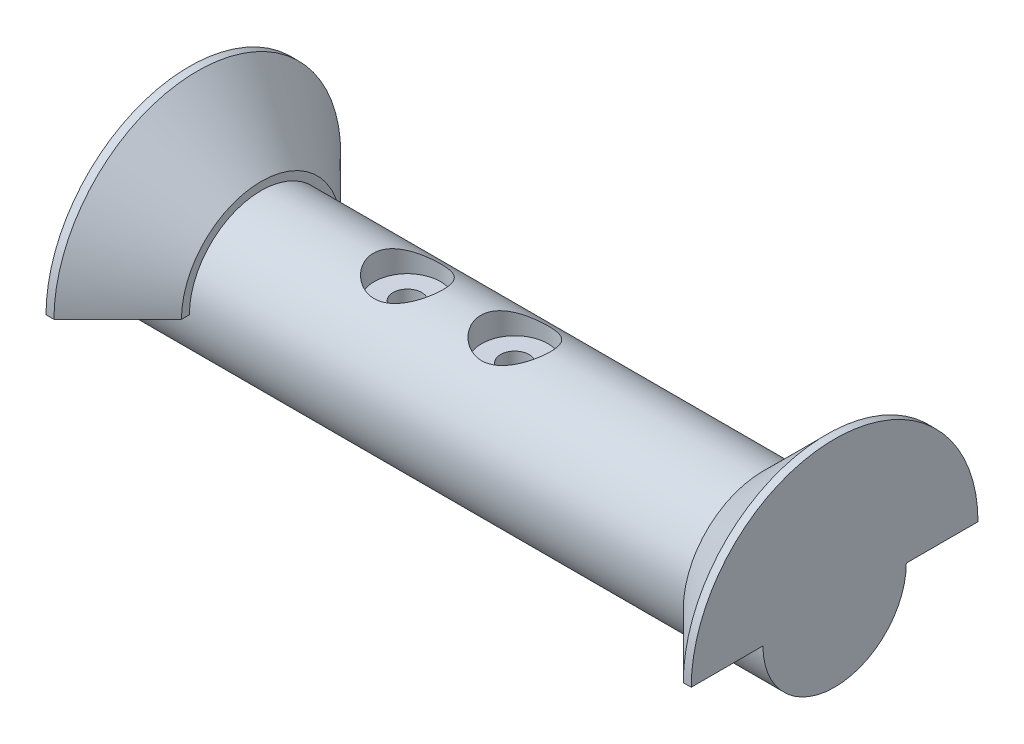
ISO-10303-21;
HEADER;
FILE_DESCRIPTION(('STEP AP214'),'2;1');
FILE_NAME('part.step','',(''),(''),'','','');
FILE_SCHEMA(('AUTOMOTIVE_DESIGN { 1 0 10303 214 1 1 1 1 }'));
ENDSEC;
DATA;
#1=APPLICATION_CONTEXT('core data for automotive mechanical design processes');
#2=APPLICATION_PROTOCOL_DEFINITION('international standard','automotive_design',2000,#1);
#3=PRODUCT_CONTEXT('',#1,'mechanical');
#4=PRODUCT('Part','Part','',(#3));
#5=PRODUCT_RELATED_PRODUCT_CATEGORY('part','',(#4));
#6=PRODUCT_DEFINITION_FORMATION('','',#4);
#7=PRODUCT_DEFINITION_CONTEXT('part definition',#1,'design');
#8=PRODUCT_DEFINITION('design','',#6,#7);
#9=PRODUCT_DEFINITION_SHAPE('','',#8);
#10=(LENGTH_UNIT() NAMED_UNIT(*) SI_UNIT(.MILLI.,.METRE.));
#11=(NAMED_UNIT(*) PLANE_ANGLE_UNIT() SI_UNIT($,.RADIAN.));
#12=(NAMED_UNIT(*) SI_UNIT($,.STERADIAN.) SOLID_ANGLE_UNIT());
#13=UNCERTAINTY_MEASURE_WITH_UNIT(LENGTH_MEASURE(1.E-05),#10,'distance_accuracy_value','');
#14=(GEOMETRIC_REPRESENTATION_CONTEXT(3) GLOBAL_UNCERTAINTY_ASSIGNED_CONTEXT((#13)) GLOBAL_UNIT_ASSIGNED_CONTEXT((#10,
#11,#12)) REPRESENTATION_CONTEXT('',''));
#15=CARTESIAN_POINT('',(0.,0.,0.));
#16=DIRECTION('',(0.,0.,1.));
#17=DIRECTION('',(1.,0.,0.));
#18=AXIS2_PLACEMENT_3D('',#15,#16,#17);
#19=CARTESIAN_POINT('',(-45.,0.,0.));
#20=DIRECTION('',(1.,0.,0.));
#21=DIRECTION('',(0.,0.,-1.));
#22=AXIS2_PLACEMENT_3D('',#19,#20,#21);
#23=CYLINDRICAL_SURFACE('',#22,10.);
#24=CARTESIAN_POINT('',(-14.986,9.06225504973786,4.22794671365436));
#25=CARTESIAN_POINT('',(-15.1094369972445,9.0622561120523,4.22794575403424));
#26=CARTESIAN_POINT('',(-15.2328995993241,9.06456878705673,4.22299840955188));
#27=CARTESIAN_POINT('',(-15.4789147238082,9.07373677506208,4.2032624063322));
#28=CARTESIAN_POINT('',(-15.6014667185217,9.08059454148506,4.18846843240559));
#29=CARTESIAN_POINT('',(-15.8449162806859,9.09862026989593,4.14916605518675));
#30=CARTESIAN_POINT('',(-15.9658104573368,9.10979600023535,4.12464014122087));
#31=CARTESIAN_POINT('',(-16.2048752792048,9.13605385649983,4.06614510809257));
#32=CARTESIAN_POINT('',(-16.3230447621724,9.15113761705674,4.03217203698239));
#33=CARTESIAN_POINT('',(-16.6712062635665,9.20135800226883,3.91689784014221));
#34=CARTESIAN_POINT('',(-16.8961363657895,9.24156751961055,3.82203051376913));
#35=CARTESIAN_POINT('',(-17.3268098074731,9.33059345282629,3.59921175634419));
#36=CARTESIAN_POINT('',(-17.5325549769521,9.37940904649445,3.47126348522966));
#37=CARTESIAN_POINT('',(-17.9326336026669,9.4833008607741,3.1769133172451));
#38=CARTESIAN_POINT('',(-18.1255721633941,9.5385766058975,3.0086845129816));
#39=CARTESIAN_POINT('',(-18.4815969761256,9.6465289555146,2.64213175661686));
#40=CARTESIAN_POINT('',(-18.6446732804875,9.69920468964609,2.44379781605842));
#41=CARTESIAN_POINT('',(-18.8662389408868,9.77263122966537,2.12329258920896));
#42=CARTESIAN_POINT('',(-18.9373142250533,9.79655407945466,2.01035384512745));
#43=CARTESIAN_POINT('',(-19.0696553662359,9.84131860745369,1.77830770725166));
#44=CARTESIAN_POINT('',(-19.1309254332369,9.86216160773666,1.65920299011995));
#45=CARTESIAN_POINT('',(-19.2430876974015,9.90006034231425,1.41562767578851));
#46=CARTESIAN_POINT('',(-19.293980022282,9.9171161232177,1.29115714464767));
#47=CARTESIAN_POINT('',(-19.3848400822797,9.94681518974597,1.03784109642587));
#48=CARTESIAN_POINT('',(-19.424813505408,9.95946077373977,0.90899789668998));
#49=CARTESIAN_POINT('',(-19.4911949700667,9.97918468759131,0.65640574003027));
#50=CARTESIAN_POINT('',(-19.5183139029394,9.98657053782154,0.532867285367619));
#51=CARTESIAN_POINT('',(-19.5623493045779,9.99674681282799,0.283850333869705));
#52=CARTESIAN_POINT('',(-19.5792703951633,9.99953932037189,0.158372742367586));
#53=CARTESIAN_POINT('',(-19.6027641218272,10.000355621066,-0.0935473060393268));
#54=CARTESIAN_POINT('',(-19.6093380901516,9.99838002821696,-0.219989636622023));
#55=CARTESIAN_POINT('',(-19.6121072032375,9.98961685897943,-0.472816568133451));
#56=CARTESIAN_POINT('',(-19.6083026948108,9.98282944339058,-0.599201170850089));
#57=CARTESIAN_POINT('',(-19.5909634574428,9.96510045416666,-0.843073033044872));
#58=CARTESIAN_POINT('',(-19.5780478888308,9.95444314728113,-0.960625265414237));
#59=CARTESIAN_POINT('',(-19.5433515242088,9.92915870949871,-1.19399238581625));
#60=CARTESIAN_POINT('',(-19.5215678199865,9.91453027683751,-1.309806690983));
#61=CARTESIAN_POINT('',(-19.443266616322,9.8650662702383,-1.65342215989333));
#62=CARTESIAN_POINT('',(-19.3737831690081,9.82463571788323,-1.87761122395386));
#63=CARTESIAN_POINT('',(-19.2003960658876,9.73049842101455,-2.31724070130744));
#64=CARTESIAN_POINT('',(-19.0955135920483,9.67642664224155,-2.53221044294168));
#65=CARTESIAN_POINT('',(-18.8552234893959,9.55984969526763,-2.94188059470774));
#66=CARTESIAN_POINT('',(-18.7198031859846,9.49734102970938,-3.1365725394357));
#67=CARTESIAN_POINT('',(-18.4078102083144,9.36266476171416,-3.51929006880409));
#68=CARTESIAN_POINT('',(-18.22858755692,9.29013879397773,-3.70502767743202));
#69=CARTESIAN_POINT('',(-17.8410263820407,9.14734136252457,-4.04476751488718));
#70=CARTESIAN_POINT('',(-17.6326686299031,9.07707142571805,-4.19874861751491));
#71=CARTESIAN_POINT('',(-17.2967073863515,8.97750681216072,-4.40574733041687));
#72=CARTESIAN_POINT('',(-17.178045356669,8.94466727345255,-4.47186840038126));
#73=CARTESIAN_POINT('',(-16.9345992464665,8.88269769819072,-4.59372910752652));
#74=CARTESIAN_POINT('',(-16.8098179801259,8.85356597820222,-4.6494734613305));
#75=CARTESIAN_POINT('',(-16.5550152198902,8.80007845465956,-4.74993280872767));
#76=CARTESIAN_POINT('',(-16.4249978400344,8.77571898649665,-4.79465627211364));
#77=CARTESIAN_POINT('',(-16.1606193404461,8.732723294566,-4.87252785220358));
#78=CARTESIAN_POINT('',(-16.0262588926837,8.71408619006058,-4.90567775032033));
#79=CARTESIAN_POINT('',(-15.7673895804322,8.68481737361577,-4.95729157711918));
#80=CARTESIAN_POINT('',(-15.6431668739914,8.67359067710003,-4.97685651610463));
#81=CARTESIAN_POINT('',(-15.3931616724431,8.65691111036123,-5.00581385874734));
#82=CARTESIAN_POINT('',(-15.267379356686,8.65145758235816,-5.01520742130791));
#83=CARTESIAN_POINT('',(-15.0154063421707,8.6465424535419,-5.02367671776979));
#84=CARTESIAN_POINT('',(-14.8892158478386,8.64707821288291,-5.02275699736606));
#85=CARTESIAN_POINT('',(-14.6375043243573,8.65411333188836,-5.0106258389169));
#86=CARTESIAN_POINT('',(-14.5119832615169,8.66061238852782,-4.99941492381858));
#87=CARTESIAN_POINT('',(-14.2753001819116,8.67836964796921,-4.96851898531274));
#88=CARTESIAN_POINT('',(-14.1639688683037,8.68908058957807,-4.94980472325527));
#89=CARTESIAN_POINT('',(-13.9434309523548,8.71477609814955,-4.90442139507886));
#90=CARTESIAN_POINT('',(-13.8342250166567,8.72976198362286,-4.87774987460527));
#91=CARTESIAN_POINT('',(-13.5108248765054,8.78050321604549,-4.78619799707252));
#92=CARTESIAN_POINT('',(-13.3006917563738,8.82205483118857,-4.70975945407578));
#93=CARTESIAN_POINT('',(-12.8842717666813,8.91900090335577,-4.52360216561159));
#94=CARTESIAN_POINT('',(-12.678885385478,8.97504891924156,-4.41223609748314));
#95=CARTESIAN_POINT('',(-12.288492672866,9.09420885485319,-4.16109018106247));
#96=CARTESIAN_POINT('',(-12.1034971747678,9.15732449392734,-4.02129534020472));
#97=CARTESIAN_POINT('',(-11.7349329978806,9.2934278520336,-3.69687585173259));
#98=CARTESIAN_POINT('',(-11.5544636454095,9.36665961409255,-3.50882554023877));
#99=CARTESIAN_POINT('',(-11.2267822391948,9.5085287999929,-3.10383370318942));
#100=CARTESIAN_POINT('',(-11.0795812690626,9.57716468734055,-2.88688258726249));
#101=CARTESIAN_POINT('',(-10.8853326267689,9.67274483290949,-2.54027960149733));
#102=CARTESIAN_POINT('',(-10.8243515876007,9.70375553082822,-2.41936505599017));
#103=CARTESIAN_POINT('',(-10.7129657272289,9.76211266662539,-2.17192837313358));
#104=CARTESIAN_POINT('',(-10.66255633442,9.78946068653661,-2.04540868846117));
#105=CARTESIAN_POINT('',(-10.5729094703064,9.83978682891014,-1.78768953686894));
#106=CARTESIAN_POINT('',(-10.533667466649,9.86276672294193,-1.65649199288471));
#107=CARTESIAN_POINT('',(-10.4668530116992,9.90378157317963,-1.39040289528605));
#108=CARTESIAN_POINT('',(-10.43927928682,9.92181706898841,-1.25551174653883));
#109=CARTESIAN_POINT('',(-10.3980594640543,9.95118289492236,-0.994823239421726));
#110=CARTESIAN_POINT('',(-10.3834265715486,9.96295371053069,-0.869230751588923));
#111=CARTESIAN_POINT('',(-10.3644975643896,9.98175379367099,-0.616919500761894));
#112=CARTESIAN_POINT('',(-10.3602006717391,9.98878341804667,-0.490200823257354));
#113=CARTESIAN_POINT('',(-10.362043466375,9.99800256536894,-0.23670085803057));
#114=CARTESIAN_POINT('',(-10.3681800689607,10.0001935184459,-0.109919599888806));
#115=CARTESIAN_POINT('',(-10.3908528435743,9.99977962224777,0.142697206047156));
#116=CARTESIAN_POINT('',(-10.4073887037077,9.99717491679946,0.268532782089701));
#117=CARTESIAN_POINT('',(-10.4492939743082,9.98766366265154,0.510115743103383));
#118=CARTESIAN_POINT('',(-10.4740185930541,9.98104805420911,0.625986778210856));
#119=CARTESIAN_POINT('',(-10.5321940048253,9.96402546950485,0.855243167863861));
#120=CARTESIAN_POINT('',(-10.565647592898,9.95361727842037,0.968627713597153));
#121=CARTESIAN_POINT('',(-10.6786821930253,9.91717031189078,1.30386702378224));
#122=CARTESIAN_POINT('',(-10.77097411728,9.88589989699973,1.52101878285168));
#123=CARTESIAN_POINT('',(-10.9899681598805,9.81163625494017,1.94411132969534));
#124=CARTESIAN_POINT('',(-11.1176989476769,9.76829239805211,2.1494513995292));
#125=CARTESIAN_POINT('',(-11.4026432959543,9.6749124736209,2.53688878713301));
#126=CARTESIAN_POINT('',(-11.5598681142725,9.62487385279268,2.71897718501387));
#127=CARTESIAN_POINT('',(-11.9139130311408,9.51902322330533,3.06992663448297));
#128=CARTESIAN_POINT('',(-12.112893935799,9.4630695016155,3.23656582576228));
#129=CARTESIAN_POINT('',(-12.5370483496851,9.35572344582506,3.53492087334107));
#130=CARTESIAN_POINT('',(-12.762239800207,9.30433427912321,3.66661260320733));
#131=CARTESIAN_POINT('',(-13.1176687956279,9.23525035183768,3.8358767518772));
#132=CARTESIAN_POINT('',(-13.2403786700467,9.21338209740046,3.887952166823));
#133=CARTESIAN_POINT('',(-13.4903516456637,9.17335901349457,3.98146657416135));
#134=CARTESIAN_POINT('',(-13.617612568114,9.15520243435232,4.02291058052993));
#135=CARTESIAN_POINT('',(-13.8754481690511,9.12335388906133,4.09462468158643));
#136=CARTESIAN_POINT('',(-14.0060140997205,9.10965124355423,4.12492152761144));
#137=CARTESIAN_POINT('',(-14.2696370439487,9.08722521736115,4.17409570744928));
#138=CARTESIAN_POINT('',(-14.402692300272,9.07849845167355,4.19298080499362));
#139=CARTESIAN_POINT('',(-14.611053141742,9.06906119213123,4.21333423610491));
#140=CARTESIAN_POINT('',(-14.6859087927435,9.066512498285,4.2188110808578));
#141=CARTESIAN_POINT('',(-14.8358397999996,9.06310907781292,4.22611766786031));
#142=CARTESIAN_POINT('',(-14.9109151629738,9.06225440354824,4.22794729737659));
#143=CARTESIAN_POINT('',(-14.986,9.06225504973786,4.22794671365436));
#144=B_SPLINE_CURVE_WITH_KNOTS('',3,(#24,#25,#26,#27,#28,#29,#30,#31,#32,#33,#34,#35,#36,#37,
#38,#39,#40,#41,#42,#43,#44,#45,#46,#47,#48,#49,#50,#51,#52,#53,#54,#55,#56,#57,#58,#59,#60,#61,
#62,#63,#64,#65,#66,#67,#68,#69,#70,#71,#72,#73,#74,#75,#76,#77,#78,#79,#80,#81,#82,#83,#84,#85,
#86,#87,#88,#89,#90,#91,#92,#93,#94,#95,#96,#97,#98,#99,#100,#101,#102,#103,#104,#105,#106,#107,
#108,#109,#110,#111,#112,#113,#114,#115,#116,#117,#118,#119,#120,#121,#122,#123,#124,#125,#126,
#127,#128,#129,#130,#131,#132,#133,#134,#135,#136,#137,#138,#139,#140,#141,#142,#143),
.UNSPECIFIED.,.T.,.F.,(4,2,2,2,2,2,2,2,2,2,2,2,2,2,2,2,2,2,2,2,2,2,2,2,2,2,2,2,2,2,2,2,2,2,2,2,
2,2,2,2,2,2,2,2,2,2,2,2,2,2,2,2,2,2,2,2,2,2,2,4),(0.,0.370234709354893,0.740669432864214,
1.11177372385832,1.48303348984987,2.22168327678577,2.96026253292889,3.74252973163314,
4.52505704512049,4.93132501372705,5.33741807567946,5.74350613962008,6.14938225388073,
6.52897189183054,6.90838936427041,7.28775798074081,7.66711392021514,8.0229028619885,
8.37880857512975,9.08997827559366,9.82268883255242,10.5557040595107,11.3566176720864,
12.1580623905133,12.5768528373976,12.9954524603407,13.4137293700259,13.8319418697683,
14.210173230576,14.5883614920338,14.9663830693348,15.344385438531,15.6841914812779,
16.0241024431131,16.7034544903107,17.4214936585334,18.1399124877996,18.9485909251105,
19.7575383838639,20.1738500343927,20.5899812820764,21.0059433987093,21.4218601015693,
21.8023262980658,22.1827638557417,22.5630889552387,22.9434026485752,23.2989700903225,
23.6546515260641,24.3653779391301,25.0993987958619,25.8337003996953,26.6267167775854,
27.4202792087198,27.8250805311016,28.2296905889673,28.6333232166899,29.036680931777,
29.2618820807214,29.4870901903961),.UNSPECIFIED.);
#145=CARTESIAN_POINT('',(-14.986,9.06225504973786,4.22794671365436));
#146=VERTEX_POINT('',#145);
#147=EDGE_CURVE('E259',#146,#146,#144,.T.);
#148=ORIENTED_EDGE('',*,*,#147,.T.);
#149=EDGE_LOOP('',(#148));
#150=FACE_BOUND('',#149,.T.);
#151=DIRECTION('',(1.,0.,0.));
#152=VECTOR('',#151,1.);
#153=CARTESIAN_POINT('',(-45.,-6.61437827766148,7.5));
#154=LINE('',#153,#152);
#155=CARTESIAN_POINT('',(43.36,-6.61437827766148,7.5));
#156=VERTEX_POINT('',#155);
#157=CARTESIAN_POINT('',(-45.,-6.61437827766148,7.5));
#158=VERTEX_POINT('',#157);
#159=EDGE_CURVE('E186',#156,#158,#154,.F.);
#160=ORIENTED_EDGE('',*,*,#159,.F.);
#161=CARTESIAN_POINT('',(43.36,0.,0.));
#162=DIRECTION('',(1.,0.,0.));
#163=DIRECTION('',(0.,0.,-1.));
#164=AXIS2_PLACEMENT_3D('',#161,#162,#163);
#165=CIRCLE('',#164,10.);
#166=CARTESIAN_POINT('',(43.36,-6.61437827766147,-7.5));
#167=VERTEX_POINT('',#166);
#168=EDGE_CURVE('E153',#167,#156,#165,.F.);
#169=ORIENTED_EDGE('',*,*,#168,.F.);
#170=DIRECTION('',(1.,0.,0.));
#171=VECTOR('',#170,1.);
#172=CARTESIAN_POINT('',(-45.,-6.61437827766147,-7.5));
#173=LINE('',#172,#171);
#174=CARTESIAN_POINT('',(-45.,-6.61437827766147,-7.5));
#175=VERTEX_POINT('',#174);
#176=EDGE_CURVE('E182',#175,#167,#173,.T.);
#177=ORIENTED_EDGE('',*,*,#176,.F.);
#178=CARTESIAN_POINT('',(-45.,0.,0.));
#179=DIRECTION('',(1.,0.,0.));
#180=DIRECTION('',(0.,0.,-1.));
#181=AXIS2_PLACEMENT_3D('',#178,#179,#180);
#182=CIRCLE('',#181,10.);
#183=CARTESIAN_POINT('',(-45.,0.,-10.));
#184=VERTEX_POINT('',#183);
#185=EDGE_CURVE('E230',#175,#184,#182,.T.);
#186=ORIENTED_EDGE('',*,*,#185,.T.);
#187=DIRECTION('',(1.,0.,0.));
#188=VECTOR('',#187,1.);
#189=CARTESIAN_POINT('',(-45.,0.,-10.));
#190=LINE('',#189,#188);
#191=CARTESIAN_POINT('',(-35.,0.,-10.));
#192=VERTEX_POINT('',#191);
#193=EDGE_CURVE('E227',#192,#184,#190,.F.);
#194=ORIENTED_EDGE('',*,*,#193,.F.);
#195=CARTESIAN_POINT('',(-35.,0.,0.));
#196=DIRECTION('',(-1.,0.,0.));
#197=DIRECTION('',(0.,0.,1.));
#198=AXIS2_PLACEMENT_3D('',#195,#196,#197);
#199=CIRCLE('',#198,10.);
#200=CARTESIAN_POINT('',(-35.,0.,10.));
#201=VERTEX_POINT('',#200);
#202=EDGE_CURVE('E234',#192,#201,#199,.F.);
#203=ORIENTED_EDGE('',*,*,#202,.T.);
#204=DIRECTION('',(1.,0.,0.));
#205=VECTOR('',#204,1.);
#206=CARTESIAN_POINT('',(-45.,0.,10.));
#207=LINE('',#206,#205);
#208=CARTESIAN_POINT('',(-45.,0.,10.));
#209=VERTEX_POINT('',#208);
#210=EDGE_CURVE('E223',#209,#201,#207,.T.);
#211=ORIENTED_EDGE('',*,*,#210,.F.);
#212=EDGE_CURVE('E231',#209,#158,#182,.T.);
#213=ORIENTED_EDGE('',*,*,#212,.T.);
#214=EDGE_LOOP('',(#160,#169,#177,#186,#194,#203,#211,#213));
#215=FACE_BOUND('',#214,.T.);
#216=CARTESIAN_POINT('',(45.,0.,0.));
#217=DIRECTION('',(1.,0.,0.));
#218=DIRECTION('',(0.,0.,-1.));
#219=AXIS2_PLACEMENT_3D('',#216,#217,#218);
#220=CIRCLE('',#219,10.);
#221=CARTESIAN_POINT('',(45.,0.,10.));
#222=VERTEX_POINT('',#221);
#223=CARTESIAN_POINT('',(45.,0.,-10.));
#224=VERTEX_POINT('',#223);
#225=EDGE_CURVE('E207',#222,#224,#220,.T.);
#226=ORIENTED_EDGE('',*,*,#225,.F.);
#227=DIRECTION('',(1.,0.,0.));
#228=VECTOR('',#227,1.);
#229=CARTESIAN_POINT('',(-45.,0.,10.));
#230=LINE('',#229,#228);
#231=CARTESIAN_POINT('',(35.,0.,10.));
#232=VERTEX_POINT('',#231);
#233=EDGE_CURVE('E204',#222,#232,#230,.F.);
#234=ORIENTED_EDGE('',*,*,#233,.T.);
#235=CARTESIAN_POINT('',(35.,0.,0.));
#236=DIRECTION('',(1.,0.,0.));
#237=DIRECTION('',(0.,0.,-1.));
#238=AXIS2_PLACEMENT_3D('',#235,#236,#237);
#239=CIRCLE('',#238,10.);
#240=CARTESIAN_POINT('',(35.,0.,-10.));
#241=VERTEX_POINT('',#240);
#242=EDGE_CURVE('E236',#232,#241,#239,.F.);
#243=ORIENTED_EDGE('',*,*,#242,.T.);
#244=DIRECTION('',(1.,0.,0.));
#245=VECTOR('',#244,1.);
#246=CARTESIAN_POINT('',(-45.,0.,-10.));
#247=LINE('',#246,#245);
#248=EDGE_CURVE('E200',#241,#224,#247,.T.);
#249=ORIENTED_EDGE('',*,*,#248,.T.);
#250=EDGE_LOOP('',(#226,#234,#243,#249));
#251=FACE_BOUND('',#250,.T.);
#252=CARTESIAN_POINT('',(0.,9.06225504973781,4.22794671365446));
#253=CARTESIAN_POINT('',(-0.123436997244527,9.06225611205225,4.22794575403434));
#254=CARTESIAN_POINT('',(-0.24689959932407,9.06456878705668,4.22299840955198));
#255=CARTESIAN_POINT('',(-0.492914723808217,9.07373677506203,4.20326240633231));
#256=CARTESIAN_POINT('',(-0.615466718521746,9.08059454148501,4.18846843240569));
#257=CARTESIAN_POINT('',(-0.858916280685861,9.09862026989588,4.14916605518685));
#258=CARTESIAN_POINT('',(-0.979810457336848,9.10979600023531,4.12464014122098));
#259=CARTESIAN_POINT('',(-1.21887527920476,9.13605385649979,4.06614510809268));
#260=CARTESIAN_POINT('',(-1.33704476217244,9.15113761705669,4.03217203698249));
#261=CARTESIAN_POINT('',(-1.68520626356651,9.20135800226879,3.91689784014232));
#262=CARTESIAN_POINT('',(-1.91013636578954,9.24156751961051,3.82203051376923));
#263=CARTESIAN_POINT('',(-2.34080980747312,9.33059345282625,3.59921175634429));
#264=CARTESIAN_POINT('',(-2.54655497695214,9.37940904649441,3.47126348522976));
#265=CARTESIAN_POINT('',(-2.94663360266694,9.48330086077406,3.17691331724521));
#266=CARTESIAN_POINT('',(-3.13957216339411,9.53857660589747,3.00868451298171));
#267=CARTESIAN_POINT('',(-3.49559697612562,9.64652895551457,2.64213175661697));
#268=CARTESIAN_POINT('',(-3.65867328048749,9.69920468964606,2.44379781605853));
#269=CARTESIAN_POINT('',(-3.8802389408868,9.77263122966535,2.12329258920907));
#270=CARTESIAN_POINT('',(-3.95131422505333,9.79655407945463,2.01035384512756));
#271=CARTESIAN_POINT('',(-4.08365536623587,9.84131860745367,1.77830770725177));
#272=CARTESIAN_POINT('',(-4.14492543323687,9.86216160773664,1.65920299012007));
#273=CARTESIAN_POINT('',(-4.25708769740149,9.90006034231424,1.41562767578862));
#274=CARTESIAN_POINT('',(-4.30798002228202,9.91711612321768,1.29115714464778));
#275=CARTESIAN_POINT('',(-4.3988400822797,9.94681518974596,1.03784109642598));
#276=CARTESIAN_POINT('',(-4.43881350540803,9.95946077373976,0.908997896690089));
#277=CARTESIAN_POINT('',(-4.50519497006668,9.9791846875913,0.656405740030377));
#278=CARTESIAN_POINT('',(-4.53231390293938,9.98657053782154,0.532867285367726));
#279=CARTESIAN_POINT('',(-4.57634930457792,9.99674681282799,0.283850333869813));
#280=CARTESIAN_POINT('',(-4.59327039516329,9.99953932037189,0.158372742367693));
#281=CARTESIAN_POINT('',(-4.61676412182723,10.000355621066,-0.0935473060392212));
#282=CARTESIAN_POINT('',(-4.62333809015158,9.99838002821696,-0.219989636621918));
#283=CARTESIAN_POINT('',(-4.62610720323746,9.98961685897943,-0.472816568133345));
#284=CARTESIAN_POINT('',(-4.6223026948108,9.98282944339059,-0.599201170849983));
#285=CARTESIAN_POINT('',(-4.60496345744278,9.96510045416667,-0.843073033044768));
#286=CARTESIAN_POINT('',(-4.59204788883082,9.95444314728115,-0.960625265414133));
#287=CARTESIAN_POINT('',(-4.55735152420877,9.92915870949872,-1.19399238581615));
#288=CARTESIAN_POINT('',(-4.53556781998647,9.91453027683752,-1.30980669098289));
#289=CARTESIAN_POINT('',(-4.45726661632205,9.86506627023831,-1.65342215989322));
#290=CARTESIAN_POINT('',(-4.38778316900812,9.82463571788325,-1.87761122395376));
#291=CARTESIAN_POINT('',(-4.21439606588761,9.73049842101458,-2.31724070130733));
#292=CARTESIAN_POINT('',(-4.10951359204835,9.67642664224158,-2.53221044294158));
#293=CARTESIAN_POINT('',(-3.86922348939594,9.55984969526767,-2.94188059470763));
#294=CARTESIAN_POINT('',(-3.73380318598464,9.49734102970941,-3.1365725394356));
#295=CARTESIAN_POINT('',(-3.4218102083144,9.3626647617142,-3.51929006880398));
#296=CARTESIAN_POINT('',(-3.24258755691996,9.29013879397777,-3.70502767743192));
#297=CARTESIAN_POINT('',(-2.85502638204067,9.14734136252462,-4.04476751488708));
#298=CARTESIAN_POINT('',(-2.64666862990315,9.0770714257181,-4.1987486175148));
#299=CARTESIAN_POINT('',(-2.31070738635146,8.97750681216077,-4.40574733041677));
#300=CARTESIAN_POINT('',(-2.19204535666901,8.94466727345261,-4.47186840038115));
#301=CARTESIAN_POINT('',(-1.94859924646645,8.88269769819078,-4.59372910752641));
#302=CARTESIAN_POINT('',(-1.82381798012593,8.85356597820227,-4.64947346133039));
#303=CARTESIAN_POINT('',(-1.56901521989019,8.80007845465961,-4.74993280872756));
#304=CARTESIAN_POINT('',(-1.43899784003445,8.77571898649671,-4.79465627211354));
#305=CARTESIAN_POINT('',(-1.17461934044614,8.73272329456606,-4.87252785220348));
#306=CARTESIAN_POINT('',(-1.04025889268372,8.71408619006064,-4.90567775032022));
#307=CARTESIAN_POINT('',(-0.781389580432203,8.68481737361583,-4.95729157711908));
#308=CARTESIAN_POINT('',(-0.657166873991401,8.67359067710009,-4.97685651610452));
#309=CARTESIAN_POINT('',(-0.407161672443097,8.65691111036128,-5.00581385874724));
#310=CARTESIAN_POINT('',(-0.281379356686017,8.65145758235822,-5.01520742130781));
#311=CARTESIAN_POINT('',(-0.0294063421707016,8.64654245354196,-5.02367671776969));
#312=CARTESIAN_POINT('',(0.0967841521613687,8.64707821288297,-5.02275699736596));
#313=CARTESIAN_POINT('',(0.348495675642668,8.65411333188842,-5.0106258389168));
#314=CARTESIAN_POINT('',(0.474016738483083,8.66061238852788,-4.99941492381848));
#315=CARTESIAN_POINT('',(0.710699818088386,8.67836964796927,-4.96851898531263));
#316=CARTESIAN_POINT('',(0.822031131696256,8.68908058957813,-4.94980472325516));
#317=CARTESIAN_POINT('',(1.04256904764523,8.71477609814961,-4.90442139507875));
#318=CARTESIAN_POINT('',(1.15177498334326,8.72976198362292,-4.87774987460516));
#319=CARTESIAN_POINT('',(1.47517512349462,8.78050321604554,-4.78619799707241));
#320=CARTESIAN_POINT('',(1.68530824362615,8.82205483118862,-4.70975945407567));
#321=CARTESIAN_POINT('',(2.10172823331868,8.91900090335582,-4.52360216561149));
#322=CARTESIAN_POINT('',(2.307114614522,8.97504891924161,-4.41223609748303));
#323=CARTESIAN_POINT('',(2.69750732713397,9.09420885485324,-4.16109018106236));
#324=CARTESIAN_POINT('',(2.88250282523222,9.15732449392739,-4.02129534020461));
#325=CARTESIAN_POINT('',(3.25106700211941,9.29342785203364,-3.69687585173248));
#326=CARTESIAN_POINT('',(3.43153635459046,9.3666596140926,-3.50882554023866));
#327=CARTESIAN_POINT('',(3.75921776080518,9.50852879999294,-3.10383370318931));
#328=CARTESIAN_POINT('',(3.90641873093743,9.57716468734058,-2.88688258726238));
#329=CARTESIAN_POINT('',(4.1006673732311,9.67274483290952,-2.54027960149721));
#330=CARTESIAN_POINT('',(4.16164841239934,9.70375553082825,-2.41936505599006));
#331=CARTESIAN_POINT('',(4.27303427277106,9.76211266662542,-2.17192837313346));
#332=CARTESIAN_POINT('',(4.32344366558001,9.78946068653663,-2.04540868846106));
#333=CARTESIAN_POINT('',(4.41309052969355,9.83978682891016,-1.78768953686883));
#334=CARTESIAN_POINT('',(4.45233253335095,9.86276672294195,-1.65649199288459));
#335=CARTESIAN_POINT('',(4.51914698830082,9.90378157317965,-1.39040289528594));
#336=CARTESIAN_POINT('',(4.54672071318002,9.92181706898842,-1.25551174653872));
#337=CARTESIAN_POINT('',(4.58794053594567,9.95118289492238,-0.994823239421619));
#338=CARTESIAN_POINT('',(4.60257342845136,9.9629537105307,-0.869230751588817));
#339=CARTESIAN_POINT('',(4.62150243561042,9.981753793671,-0.616919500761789));
#340=CARTESIAN_POINT('',(4.62579932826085,9.98878341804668,-0.490200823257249));
#341=CARTESIAN_POINT('',(4.62395653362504,9.99800256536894,-0.236700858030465));
#342=CARTESIAN_POINT('',(4.61781993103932,10.0001935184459,-0.109919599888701));
#343=CARTESIAN_POINT('',(4.59514715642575,9.99977962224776,0.142697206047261));
#344=CARTESIAN_POINT('',(4.57861129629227,9.99717491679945,0.268532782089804));
#345=CARTESIAN_POINT('',(4.53670602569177,9.98766366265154,0.510115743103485));
#346=CARTESIAN_POINT('',(4.51198140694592,9.9810480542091,0.625986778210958));
#347=CARTESIAN_POINT('',(4.45380599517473,9.96402546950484,0.855243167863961));
#348=CARTESIAN_POINT('',(4.42035240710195,9.95361727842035,0.968627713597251));
#349=CARTESIAN_POINT('',(4.30731780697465,9.91717031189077,1.30386702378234));
#350=CARTESIAN_POINT('',(4.21502588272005,9.88589989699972,1.52101878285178));
#351=CARTESIAN_POINT('',(3.9960318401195,9.81163625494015,1.94411132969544));
#352=CARTESIAN_POINT('',(3.86830105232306,9.76829239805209,2.1494513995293));
#353=CARTESIAN_POINT('',(3.58335670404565,9.67491247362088,2.53688878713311));
#354=CARTESIAN_POINT('',(3.4261318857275,9.62487385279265,2.71897718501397));
#355=CARTESIAN_POINT('',(3.07208696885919,9.51902322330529,3.06992663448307));
#356=CARTESIAN_POINT('',(2.87310606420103,9.46306950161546,3.23656582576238));
#357=CARTESIAN_POINT('',(2.44895165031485,9.35572344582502,3.53492087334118));
#358=CARTESIAN_POINT('',(2.22376019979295,9.30433427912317,3.66661260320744));
#359=CARTESIAN_POINT('',(1.86833120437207,9.23525035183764,3.8358767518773));
#360=CARTESIAN_POINT('',(1.74562132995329,9.21338209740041,3.8879521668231));
#361=CARTESIAN_POINT('',(1.49564835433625,9.17335901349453,3.98146657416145));
#362=CARTESIAN_POINT('',(1.36838743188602,9.15520243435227,4.02291058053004));
#363=CARTESIAN_POINT('',(1.1105518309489,9.12335388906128,4.09462468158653));
#364=CARTESIAN_POINT('',(0.979985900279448,9.10965124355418,4.12492152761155));
#365=CARTESIAN_POINT('',(0.716362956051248,9.08722521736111,4.17409570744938));
#366=CARTESIAN_POINT('',(0.583307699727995,9.07849845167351,4.19298080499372));
#367=CARTESIAN_POINT('',(0.374946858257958,9.06906119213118,4.21333423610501));
#368=CARTESIAN_POINT('',(0.30009120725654,9.06651249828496,4.2188110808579));
#369=CARTESIAN_POINT('',(0.150160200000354,9.06310907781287,4.22611766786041));
#370=CARTESIAN_POINT('',(0.075084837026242,9.06225440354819,4.2279472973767));
#371=CARTESIAN_POINT('',(0.,9.06225504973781,4.22794671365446));
#372=B_SPLINE_CURVE_WITH_KNOTS('',3,(#252,#253,#254,#255,#256,#257,#258,#259,#260,#261,#262,
#263,#264,#265,#266,#267,#268,#269,#270,#271,#272,#273,#274,#275,#276,#277,#278,#279,#280,#281,
#282,#283,#284,#285,#286,#287,#288,#289,#290,#291,#292,#293,#294,#295,#296,#297,#298,#299,#300,
#301,#302,#303,#304,#305,#306,#307,#308,#309,#310,#311,#312,#313,#314,#315,#316,#317,#318,#319,
#320,#321,#322,#323,#324,#325,#326,#327,#328,#329,#330,#331,#332,#333,#334,#335,#336,#337,#338,
#339,#340,#341,#342,#343,#344,#345,#346,#347,#348,#349,#350,#351,#352,#353,#354,#355,#356,#357,
#358,#359,#360,#361,#362,#363,#364,#365,#366,#367,#368,#369,#370,#371),.UNSPECIFIED.,.T.,.F.,(4,
2,2,2,2,2,2,2,2,2,2,2,2,2,2,2,2,2,2,2,2,2,2,2,2,2,2,2,2,2,2,2,2,2,2,2,2,2,2,2,2,2,2,2,2,2,2,2,2,
2,2,2,2,2,2,2,2,2,2,4),(0.,0.370234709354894,0.740669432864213,1.11177372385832,
1.48303348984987,2.22168327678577,2.96026253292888,3.74252973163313,4.52505704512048,
4.93132501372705,5.33741807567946,5.74350613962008,6.14938225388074,6.52897189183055,
6.90838936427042,7.28775798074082,7.66711392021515,8.02290286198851,8.37880857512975,
9.08997827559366,9.82268883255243,10.5557040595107,11.3566176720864,12.1580623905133,
12.5768528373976,12.9954524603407,13.4137293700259,13.8319418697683,14.210173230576,
14.5883614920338,14.9663830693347,15.344385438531,15.6841914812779,16.0241024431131,
16.7034544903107,17.4214936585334,18.1399124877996,18.9485909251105,19.7575383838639,
20.1738500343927,20.5899812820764,21.0059433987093,21.4218601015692,21.8023262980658,
22.1827638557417,22.5630889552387,22.9434026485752,23.2989700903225,23.654651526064,
24.3653779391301,25.0993987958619,25.8337003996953,26.6267167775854,27.4202792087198,
27.8250805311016,28.2296905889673,28.6333232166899,29.036680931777,29.2618820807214,
29.4870901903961),.UNSPECIFIED.);
#373=CARTESIAN_POINT('',(0.,9.06225504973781,4.22794671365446));
#374=VERTEX_POINT('',#373);
#375=EDGE_CURVE('E271',#374,#374,#372,.T.);
#376=ORIENTED_EDGE('',*,*,#375,.T.);
#377=EDGE_LOOP('',(#376));
#378=FACE_BOUND('',#377,.T.);
#379=ADVANCED_FACE('F33',(#150,#215,#251,#378),#23,.T.);
#380=CARTESIAN_POINT('',(43.36,0.,-7.5));
#381=DIRECTION('',(0.,1.,0.));
#382=DIRECTION('',(0.,0.,1.));
#383=AXIS2_PLACEMENT_3D('',#380,#381,#382);
#384=PLANE('',#383);
#385=DIRECTION('',(-1.,0.,0.));
#386=VECTOR('',#385,1.);
#387=CARTESIAN_POINT('',(43.36,0.,-7.5));
#388=LINE('',#387,#386);
#389=CARTESIAN_POINT('',(-16.626807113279,0.,-7.5));
#390=VERTEX_POINT('',#389);
#391=CARTESIAN_POINT('',(-45.,0.,-7.5));
#392=VERTEX_POINT('',#391);
#393=EDGE_CURVE('E166',#390,#392,#388,.T.);
#394=ORIENTED_EDGE('',*,*,#393,.F.);
#395=CARTESIAN_POINT('',(-14.986,0.,-0.397053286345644));
#396=DIRECTION('',(0.,1.,0.));
#397=DIRECTION('',(0.,0.,1.));
#398=AXIS2_PLACEMENT_3D('',#395,#396,#397);
#399=CIRCLE('',#398,7.29000000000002);
#400=CARTESIAN_POINT('',(-13.345192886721,0.,-7.5));
#401=VERTEX_POINT('',#400);
#402=EDGE_CURVE('E354',#390,#401,#399,.T.);
#403=ORIENTED_EDGE('',*,*,#402,.T.);
#404=CARTESIAN_POINT('',(-1.64080711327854,0.,-7.5));
#405=VERTEX_POINT('',#404);
#406=EDGE_CURVE('E183',#405,#401,#388,.T.);
#407=ORIENTED_EDGE('',*,*,#406,.F.);
#408=CARTESIAN_POINT('',(0.,0.,-0.397053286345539));
#409=DIRECTION('',(0.,1.,0.));
#410=DIRECTION('',(0.,0.,1.));
#411=AXIS2_PLACEMENT_3D('',#408,#409,#410);
#412=CIRCLE('',#411,7.29000000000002);
#413=CARTESIAN_POINT('',(1.64080711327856,0.,-7.5));
#414=VERTEX_POINT('',#413);
#415=EDGE_CURVE('E353',#405,#414,#412,.T.);
#416=ORIENTED_EDGE('',*,*,#415,.T.);
#417=CARTESIAN_POINT('',(43.36,0.,-7.5));
#418=VERTEX_POINT('',#417);
#419=EDGE_CURVE('E172',#418,#414,#388,.T.);
#420=ORIENTED_EDGE('',*,*,#419,.F.);
#421=DIRECTION('',(0.,0.,-1.));
#422=VECTOR('',#421,1.);
#423=CARTESIAN_POINT('',(43.36,0.,-7.5));
#424=LINE('',#423,#422);
#425=CARTESIAN_POINT('',(43.36,0.,7.5));
#426=VERTEX_POINT('',#425);
#427=EDGE_CURVE('E151',#426,#418,#424,.T.);
#428=ORIENTED_EDGE('',*,*,#427,.F.);
#429=DIRECTION('',(-1.,0.,0.));
#430=VECTOR('',#429,1.);
#431=CARTESIAN_POINT('',(43.36,0.,7.5));
#432=LINE('',#431,#430);
#433=CARTESIAN_POINT('',(-45.,0.,7.5));
#434=VERTEX_POINT('',#433);
#435=EDGE_CURVE('E159',#426,#434,#432,.T.);
#436=ORIENTED_EDGE('',*,*,#435,.T.);
#437=DIRECTION('',(0.,0.,-1.));
#438=VECTOR('',#437,1.);
#439=CARTESIAN_POINT('',(-45.,0.,-7.5));
#440=LINE('',#439,#438);
#441=EDGE_CURVE('E178',#434,#392,#440,.T.);
#442=ORIENTED_EDGE('',*,*,#441,.T.);
#443=EDGE_LOOP('',(#394,#403,#407,#416,#420,#428,#436,#442));
#444=FACE_BOUND('',#443,.T.);
#445=ADVANCED_FACE('F169',(#444),#384,.F.);
#446=CARTESIAN_POINT('',(-45.,0.,0.));
#447=DIRECTION('',(1.,0.,0.));
#448=DIRECTION('',(0.,0.,-1.));
#449=AXIS2_PLACEMENT_3D('',#446,#447,#448);
#450=PLANE('',#449);
#451=ORIENTED_EDGE('',*,*,#441,.F.);
#452=DIRECTION('',(0.,-1.,0.));
#453=VECTOR('',#452,1.);
#454=CARTESIAN_POINT('',(-45.,0.,7.5));
#455=LINE('',#454,#453);
#456=EDGE_CURVE('E162',#434,#158,#455,.T.);
#457=ORIENTED_EDGE('',*,*,#456,.T.);
#458=ORIENTED_EDGE('',*,*,#212,.F.);
#459=DIRECTION('',(0.,0.,1.));
#460=VECTOR('',#459,1.);
#461=CARTESIAN_POINT('',(-45.,0.,-20.));
#462=LINE('',#461,#460);
#463=CARTESIAN_POINT('',(-45.,0.,20.));
#464=VERTEX_POINT('',#463);
#465=EDGE_CURVE('E217',#209,#464,#462,.T.);
#466=ORIENTED_EDGE('',*,*,#465,.T.);
#467=CARTESIAN_POINT('',(-45.,0.,0.));
#468=DIRECTION('',(-1.,0.,0.));
#469=DIRECTION('',(0.,0.,1.));
#470=AXIS2_PLACEMENT_3D('',#467,#468,#469);
#471=CIRCLE('',#470,20.);
#472=CARTESIAN_POINT('',(-45.,0.,-20.));
#473=VERTEX_POINT('',#472);
#474=EDGE_CURVE('E210',#464,#473,#471,.T.);
#475=ORIENTED_EDGE('',*,*,#474,.T.);
#476=EDGE_CURVE('E218',#473,#184,#462,.T.);
#477=ORIENTED_EDGE('',*,*,#476,.T.);
#478=ORIENTED_EDGE('',*,*,#185,.F.);
#479=DIRECTION('',(0.,-1.,0.));
#480=VECTOR('',#479,1.);
#481=CARTESIAN_POINT('',(-45.,-20.,-7.5));
#482=LINE('',#481,#480);
#483=EDGE_CURVE('E156',#392,#175,#482,.T.);
#484=ORIENTED_EDGE('',*,*,#483,.F.);
#485=EDGE_LOOP('',(#451,#457,#458,#466,#475,#477,#478,#484));
#486=FACE_BOUND('',#485,.T.);
#487=ADVANCED_FACE('F344',(#486),#450,.F.);
#488=CARTESIAN_POINT('',(-35.,0.,-20.));
#489=DIRECTION('',(0.,-1.,0.));
#490=DIRECTION('',(0.,0.,-1.));
#491=AXIS2_PLACEMENT_3D('',#488,#489,#490);
#492=PLANE('',#491);
#493=DIRECTION('',(-1.,0.,0.));
#494=VECTOR('',#493,1.);
#495=CARTESIAN_POINT('',(-35.,0.,-20.));
#496=LINE('',#495,#494);
#497=CARTESIAN_POINT('',(-43.89,0.,-20.));
#498=VERTEX_POINT('',#497);
#499=EDGE_CURVE('E213',#498,#473,#496,.T.);
#500=ORIENTED_EDGE('',*,*,#499,.F.);
#501=DIRECTION('',(0.707106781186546,0.,0.707106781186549));
#502=VECTOR('',#501,1.);
#503=CARTESIAN_POINT('',(-23.8900000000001,0.,0.));
#504=LINE('',#503,#502);
#505=CARTESIAN_POINT('',(-35.,0.,-11.11));
#506=VERTEX_POINT('',#505);
#507=EDGE_CURVE('E242',#498,#506,#504,.T.);
#508=ORIENTED_EDGE('',*,*,#507,.T.);
#509=DIRECTION('',(0.,0.,1.));
#510=VECTOR('',#509,1.);
#511=CARTESIAN_POINT('',(-35.,0.,-20.));
#512=LINE('',#511,#510);
#513=EDGE_CURVE('E211',#506,#192,#512,.T.);
#514=ORIENTED_EDGE('',*,*,#513,.T.);
#515=ORIENTED_EDGE('',*,*,#193,.T.);
#516=ORIENTED_EDGE('',*,*,#476,.F.);
#517=EDGE_LOOP('',(#500,#508,#514,#515,#516));
#518=FACE_BOUND('',#517,.T.);
#519=ADVANCED_FACE('F469',(#518),#492,.T.);
#520=CARTESIAN_POINT('',(-35.,0.,0.));
#521=DIRECTION('',(-1.,0.,0.));
#522=DIRECTION('',(0.,0.,1.));
#523=AXIS2_PLACEMENT_3D('',#520,#521,#522);
#524=CYLINDRICAL_SURFACE('',#523,20.);
#525=DIRECTION('',(-1.,0.,0.));
#526=VECTOR('',#525,1.);
#527=CARTESIAN_POINT('',(-35.,0.,20.));
#528=LINE('',#527,#526);
#529=CARTESIAN_POINT('',(-43.89,0.,20.));
#530=VERTEX_POINT('',#529);
#531=EDGE_CURVE('E221',#530,#464,#528,.T.);
#532=ORIENTED_EDGE('',*,*,#531,.F.);
#533=CARTESIAN_POINT('',(-43.89,0.,0.));
#534=DIRECTION('',(-1.,0.,0.));
#535=DIRECTION('',(0.,0.,1.));
#536=AXIS2_PLACEMENT_3D('',#533,#534,#535);
#537=CIRCLE('',#536,20.);
#538=EDGE_CURVE('E239',#530,#498,#537,.T.);
#539=ORIENTED_EDGE('',*,*,#538,.T.);
#540=ORIENTED_EDGE('',*,*,#499,.T.);
#541=ORIENTED_EDGE('',*,*,#474,.F.);
#542=EDGE_LOOP('',(#532,#539,#540,#541));
#543=FACE_BOUND('',#542,.T.);
#544=ADVANCED_FACE('F484',(#543),#524,.T.);
#545=CARTESIAN_POINT('',(-35.,0.,11.11));
#546=VERTEX_POINT('',#545);
#547=EDGE_CURVE('E214',#201,#546,#512,.T.);
#548=ORIENTED_EDGE('',*,*,#547,.T.);
#549=DIRECTION('',(-0.707106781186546,0.,0.707106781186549));
#550=VECTOR('',#549,1.);
#551=CARTESIAN_POINT('',(-23.8900000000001,0.,0.));
#552=LINE('',#551,#550);
#553=EDGE_CURVE('E246',#546,#530,#552,.T.);
#554=ORIENTED_EDGE('',*,*,#553,.T.);
#555=ORIENTED_EDGE('',*,*,#531,.T.);
#556=ORIENTED_EDGE('',*,*,#465,.F.);
#557=ORIENTED_EDGE('',*,*,#210,.T.);
#558=EDGE_LOOP('',(#548,#554,#555,#556,#557));
#559=FACE_BOUND('',#558,.T.);
#560=ADVANCED_FACE('F479',(#559),#492,.T.);
#561=CARTESIAN_POINT('',(-35.,0.,0.));
#562=DIRECTION('',(-1.,0.,0.));
#563=DIRECTION('',(0.,0.,1.));
#564=AXIS2_PLACEMENT_3D('',#561,#562,#563);
#565=PLANE('',#564);
#566=ORIENTED_EDGE('',*,*,#513,.F.);
#567=CARTESIAN_POINT('',(-35.,0.,0.));
#568=DIRECTION('',(-1.,0.,0.));
#569=DIRECTION('',(0.,0.,1.));
#570=AXIS2_PLACEMENT_3D('',#567,#568,#569);
#571=CIRCLE('',#570,11.11);
#572=EDGE_CURVE('E244',#506,#546,#571,.F.);
#573=ORIENTED_EDGE('',*,*,#572,.T.);
#574=ORIENTED_EDGE('',*,*,#547,.F.);
#575=ORIENTED_EDGE('',*,*,#202,.F.);
#576=EDGE_LOOP('',(#566,#573,#574,#575));
#577=FACE_BOUND('',#576,.T.);
#578=ADVANCED_FACE('F475',(#577),#565,.F.);
#579=CARTESIAN_POINT('',(45.,0.,0.));
#580=DIRECTION('',(-1.,0.,0.));
#581=DIRECTION('',(0.,0.,-1.));
#582=AXIS2_PLACEMENT_3D('',#579,#580,#581);
#583=PLANE('',#582);
#584=ORIENTED_EDGE('',*,*,#225,.T.);
#585=DIRECTION('',(0.,0.,1.));
#586=VECTOR('',#585,1.);
#587=CARTESIAN_POINT('',(45.,0.,-20.));
#588=LINE('',#587,#586);
#589=CARTESIAN_POINT('',(45.,0.,-20.));
#590=VERTEX_POINT('',#589);
#591=EDGE_CURVE('E196',#590,#224,#588,.T.);
#592=ORIENTED_EDGE('',*,*,#591,.F.);
#593=CARTESIAN_POINT('',(45.,0.,0.));
#594=DIRECTION('',(-1.,0.,0.));
#595=DIRECTION('',(0.,0.,1.));
#596=AXIS2_PLACEMENT_3D('',#593,#594,#595);
#597=CIRCLE('',#596,20.);
#598=CARTESIAN_POINT('',(45.,0.,20.));
#599=VERTEX_POINT('',#598);
#600=EDGE_CURVE('E188',#599,#590,#597,.T.);
#601=ORIENTED_EDGE('',*,*,#600,.F.);
#602=EDGE_CURVE('E195',#222,#599,#588,.T.);
#603=ORIENTED_EDGE('',*,*,#602,.F.);
#604=EDGE_LOOP('',(#584,#592,#601,#603));
#605=FACE_BOUND('',#604,.T.);
#606=ADVANCED_FACE('F510',(#605),#583,.F.);
#607=CARTESIAN_POINT('',(35.,0.,-20.));
#608=DIRECTION('',(0.,1.,0.));
#609=DIRECTION('',(0.,0.,1.));
#610=AXIS2_PLACEMENT_3D('',#607,#608,#609);
#611=PLANE('',#610);
#612=DIRECTION('',(1.,0.,0.));
#613=VECTOR('',#612,1.);
#614=CARTESIAN_POINT('',(35.,0.,20.));
#615=LINE('',#614,#613);
#616=CARTESIAN_POINT('',(43.89,0.,20.));
#617=VERTEX_POINT('',#616);
#618=EDGE_CURVE('E191',#617,#599,#615,.T.);
#619=ORIENTED_EDGE('',*,*,#618,.F.);
#620=DIRECTION('',(0.707106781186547,0.,0.707106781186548));
#621=VECTOR('',#620,1.);
#622=CARTESIAN_POINT('',(23.89,0.,0.));
#623=LINE('',#622,#621);
#624=CARTESIAN_POINT('',(35.,0.,11.11));
#625=VERTEX_POINT('',#624);
#626=EDGE_CURVE('E255',#617,#625,#623,.F.);
#627=ORIENTED_EDGE('',*,*,#626,.T.);
#628=DIRECTION('',(0.,0.,1.));
#629=VECTOR('',#628,1.);
#630=CARTESIAN_POINT('',(35.,0.,-20.));
#631=LINE('',#630,#629);
#632=EDGE_CURVE('E192',#232,#625,#631,.T.);
#633=ORIENTED_EDGE('',*,*,#632,.F.);
#634=ORIENTED_EDGE('',*,*,#233,.F.);
#635=ORIENTED_EDGE('',*,*,#602,.T.);
#636=EDGE_LOOP('',(#619,#627,#633,#634,#635));
#637=FACE_BOUND('',#636,.T.);
#638=ADVANCED_FACE('F538',(#637),#611,.F.);
#639=CARTESIAN_POINT('',(35.,0.,0.));
#640=DIRECTION('',(1.,0.,0.));
#641=DIRECTION('',(0.,0.,-1.));
#642=AXIS2_PLACEMENT_3D('',#639,#640,#641);
#643=CYLINDRICAL_SURFACE('',#642,20.);
#644=DIRECTION('',(1.,0.,0.));
#645=VECTOR('',#644,1.);
#646=CARTESIAN_POINT('',(35.,0.,-20.));
#647=LINE('',#646,#645);
#648=CARTESIAN_POINT('',(43.89,0.,-20.));
#649=VERTEX_POINT('',#648);
#650=EDGE_CURVE('E198',#649,#590,#647,.T.);
#651=ORIENTED_EDGE('',*,*,#650,.F.);
#652=CARTESIAN_POINT('',(43.89,0.,0.));
#653=DIRECTION('',(1.,0.,0.));
#654=DIRECTION('',(0.,0.,-1.));
#655=AXIS2_PLACEMENT_3D('',#652,#653,#654);
#656=CIRCLE('',#655,20.);
#657=EDGE_CURVE('E253',#649,#617,#656,.T.);
#658=ORIENTED_EDGE('',*,*,#657,.T.);
#659=ORIENTED_EDGE('',*,*,#618,.T.);
#660=ORIENTED_EDGE('',*,*,#600,.T.);
#661=EDGE_LOOP('',(#651,#658,#659,#660));
#662=FACE_BOUND('',#661,.T.);
#663=ADVANCED_FACE('F543',(#662),#643,.T.);
#664=CARTESIAN_POINT('',(35.,0.,-11.11));
#665=VERTEX_POINT('',#664);
#666=EDGE_CURVE('E189',#665,#241,#631,.T.);
#667=ORIENTED_EDGE('',*,*,#666,.F.);
#668=DIRECTION('',(-0.707106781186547,0.,0.707106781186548));
#669=VECTOR('',#668,1.);
#670=CARTESIAN_POINT('',(23.89,0.,0.));
#671=LINE('',#670,#669);
#672=EDGE_CURVE('E251',#665,#649,#671,.F.);
#673=ORIENTED_EDGE('',*,*,#672,.T.);
#674=ORIENTED_EDGE('',*,*,#650,.T.);
#675=ORIENTED_EDGE('',*,*,#591,.T.);
#676=ORIENTED_EDGE('',*,*,#248,.F.);
#677=EDGE_LOOP('',(#667,#673,#674,#675,#676));
#678=FACE_BOUND('',#677,.T.);
#679=ADVANCED_FACE('F335',(#678),#611,.F.);
#680=CARTESIAN_POINT('',(35.,0.,0.));
#681=DIRECTION('',(1.,0.,0.));
#682=DIRECTION('',(0.,0.,1.));
#683=AXIS2_PLACEMENT_3D('',#680,#681,#682);
#684=PLANE('',#683);
#685=ORIENTED_EDGE('',*,*,#632,.T.);
#686=CARTESIAN_POINT('',(35.,0.,0.));
#687=DIRECTION('',(1.,0.,0.));
#688=DIRECTION('',(0.,0.,-1.));
#689=AXIS2_PLACEMENT_3D('',#686,#687,#688);
#690=CIRCLE('',#689,11.11);
#691=EDGE_CURVE('E248',#625,#665,#690,.F.);
#692=ORIENTED_EDGE('',*,*,#691,.T.);
#693=ORIENTED_EDGE('',*,*,#666,.T.);
#694=ORIENTED_EDGE('',*,*,#242,.F.);
#695=EDGE_LOOP('',(#685,#692,#693,#694));
#696=FACE_BOUND('',#695,.T.);
#697=ADVANCED_FACE('F330',(#696),#684,.F.);
#698=CARTESIAN_POINT('',(-43.89,0.,0.));
#699=DIRECTION('',(-1.,0.,0.));
#700=DIRECTION('',(0.,0.,1.));
#701=AXIS2_PLACEMENT_3D('',#698,#699,#700);
#702=CONICAL_SURFACE('',#701,20.,0.78539816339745);
#703=ORIENTED_EDGE('',*,*,#553,.F.);
#704=ORIENTED_EDGE('',*,*,#572,.F.);
#705=ORIENTED_EDGE('',*,*,#507,.F.);
#706=ORIENTED_EDGE('',*,*,#538,.F.);
#707=EDGE_LOOP('',(#703,#704,#705,#706));
#708=FACE_BOUND('',#707,.T.);
#709=ADVANCED_FACE('F327',(#708),#702,.T.);
#710=CARTESIAN_POINT('',(35.,0.,0.));
#711=DIRECTION('',(1.,0.,0.));
#712=DIRECTION('',(0.,0.,-1.));
#713=AXIS2_PLACEMENT_3D('',#710,#711,#712);
#714=CONICAL_SURFACE('',#713,11.11,0.78539816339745);
#715=ORIENTED_EDGE('',*,*,#626,.F.);
#716=ORIENTED_EDGE('',*,*,#657,.F.);
#717=ORIENTED_EDGE('',*,*,#672,.F.);
#718=ORIENTED_EDGE('',*,*,#691,.F.);
#719=EDGE_LOOP('',(#715,#716,#717,#718));
#720=FACE_BOUND('',#719,.T.);
#721=ADVANCED_FACE('F325',(#720),#714,.T.);
#722=CARTESIAN_POINT('',(43.36,-20.,7.5));
#723=DIRECTION('',(0.,0.,1.));
#724=DIRECTION('',(1.,0.,0.));
#725=AXIS2_PLACEMENT_3D('',#722,#723,#724);
#726=PLANE('',#725);
#727=ORIENTED_EDGE('',*,*,#159,.T.);
#728=ORIENTED_EDGE('',*,*,#456,.F.);
#729=ORIENTED_EDGE('',*,*,#435,.F.);
#730=DIRECTION('',(0.,1.,0.));
#731=VECTOR('',#730,1.);
#732=CARTESIAN_POINT('',(43.36,-20.,7.5));
#733=LINE('',#732,#731);
#734=EDGE_CURVE('E146',#156,#426,#733,.T.);
#735=ORIENTED_EDGE('',*,*,#734,.F.);
#736=EDGE_LOOP('',(#727,#728,#729,#735));
#737=FACE_BOUND('',#736,.T.);
#738=ADVANCED_FACE('F160',(#737),#726,.F.);
#739=CARTESIAN_POINT('',(43.36,-20.,-7.5));
#740=DIRECTION('',(0.,0.,-1.));
#741=DIRECTION('',(-1.,0.,0.));
#742=AXIS2_PLACEMENT_3D('',#739,#740,#741);
#743=PLANE('',#742);
#744=ORIENTED_EDGE('',*,*,#406,.T.);
#745=CARTESIAN_POINT('',(-13.345192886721,0.,-7.5));
#746=CARTESIAN_POINT('',(-13.4339012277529,-0.0199676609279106,-7.5));
#747=CARTESIAN_POINT('',(-13.5229355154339,-0.0384679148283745,-7.5));
#748=CARTESIAN_POINT('',(-13.701597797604,-0.0723931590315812,-7.5));
#749=CARTESIAN_POINT('',(-13.79122585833,-0.087817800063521,-7.5));
#750=CARTESIAN_POINT('',(-14.0609462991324,-0.129270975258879,-7.5));
#751=CARTESIAN_POINT('',(-14.2418124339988,-0.150464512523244,-7.5));
#752=CARTESIAN_POINT('',(-14.6016438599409,-0.178886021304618,-7.5));
#753=CARTESIAN_POINT('',(-14.7805915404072,-0.18633778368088,-7.5));
#754=CARTESIAN_POINT('',(-15.1384536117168,-0.187670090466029,-7.5));
#755=CARTESIAN_POINT('',(-15.3173679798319,-0.1815568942,-7.5));
#756=CARTESIAN_POINT('',(-15.6852561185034,-0.155217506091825,-7.5));
#757=CARTESIAN_POINT('',(-15.8741700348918,-0.134144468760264,-7.5));
#758=CARTESIAN_POINT('',(-16.1567398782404,-0.0918280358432,-7.5));
#759=CARTESIAN_POINT('',(-16.2512188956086,-0.0758417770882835,-7.5));
#760=CARTESIAN_POINT('',(-16.4395214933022,-0.0404464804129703,-7.5));
#761=CARTESIAN_POINT('',(-16.5333451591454,-0.0210378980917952,-7.5));
#762=CARTESIAN_POINT('',(-16.626807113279,0.,-7.5));
#763=B_SPLINE_CURVE_WITH_KNOTS('',3,(#745,#746,#747,#748,#749,#750,#751,#752,#753,#754,#755,
#756,#757,#758,#759,#760,#761,#762),.UNSPECIFIED.,.F.,.F.,(4,2,2,2,2,2,2,2,4),(0.,
0.272760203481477,0.545551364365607,1.09132557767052,1.62813034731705,2.16468746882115,
2.73432389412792,3.02173612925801,3.30911013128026),.UNSPECIFIED.);
#764=EDGE_CURVE('E49',#401,#390,#763,.T.);
#765=ORIENTED_EDGE('',*,*,#764,.T.);
#766=ORIENTED_EDGE('',*,*,#393,.T.);
#767=ORIENTED_EDGE('',*,*,#483,.T.);
#768=ORIENTED_EDGE('',*,*,#176,.T.);
#769=DIRECTION('',(0.,-1.,0.));
#770=VECTOR('',#769,1.);
#771=CARTESIAN_POINT('',(43.36,-20.,-7.5));
#772=LINE('',#771,#770);
#773=EDGE_CURVE('E167',#418,#167,#772,.T.);
#774=ORIENTED_EDGE('',*,*,#773,.F.);
#775=ORIENTED_EDGE('',*,*,#419,.T.);
#776=CARTESIAN_POINT('',(1.64080711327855,0.,-7.5));
#777=CARTESIAN_POINT('',(1.55209877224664,-0.019967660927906,-7.5));
#778=CARTESIAN_POINT('',(1.46306448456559,-0.0384679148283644,-7.5));
#779=CARTESIAN_POINT('',(1.2844022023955,-0.0723931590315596,-7.5));
#780=CARTESIAN_POINT('',(1.19477414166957,-0.0878178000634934,-7.5));
#781=CARTESIAN_POINT('',(0.925053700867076,-0.129270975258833,-7.5));
#782=CARTESIAN_POINT('',(0.744187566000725,-0.150464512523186,-7.5));
#783=CARTESIAN_POINT('',(0.384356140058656,-0.178886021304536,-7.5));
#784=CARTESIAN_POINT('',(0.205408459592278,-0.186337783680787,-7.5));
#785=CARTESIAN_POINT('',(-0.152453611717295,-0.187670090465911,-7.5));
#786=CARTESIAN_POINT('',(-0.331367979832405,-0.18155689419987,-7.5));
#787=CARTESIAN_POINT('',(-0.699256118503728,-0.155217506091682,-7.5));
#788=CARTESIAN_POINT('',(-0.888170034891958,-0.134144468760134,-7.5));
#789=CARTESIAN_POINT('',(-1.17073987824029,-0.0918280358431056,-7.5));
#790=CARTESIAN_POINT('',(-1.26521889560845,-0.0758417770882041,-7.5));
#791=CARTESIAN_POINT('',(-1.4535214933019,-0.0404464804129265,-7.5));
#792=CARTESIAN_POINT('',(-1.54734515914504,-0.021037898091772,-7.5));
#793=CARTESIAN_POINT('',(-1.64080711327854,0.,-7.5));
#794=B_SPLINE_CURVE_WITH_KNOTS('',3,(#776,#777,#778,#779,#780,#781,#782,#783,#784,#785,#786,
#787,#788,#789,#790,#791,#792,#793),.UNSPECIFIED.,.F.,.F.,(4,2,2,2,2,2,2,2,4),(0.,
0.272760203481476,0.545551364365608,1.09132557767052,1.62813034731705,2.16468746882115,
2.73432389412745,3.02173612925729,3.30911013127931),.UNSPECIFIED.);
#795=EDGE_CURVE('E311',#414,#405,#794,.T.);
#796=ORIENTED_EDGE('',*,*,#795,.T.);
#797=EDGE_LOOP('',(#744,#765,#766,#767,#768,#774,#775,#796));
#798=FACE_BOUND('',#797,.T.);
#799=ADVANCED_FACE('F304',(#798),#743,.F.);
#800=CARTESIAN_POINT('',(43.36,0.,0.));
#801=DIRECTION('',(1.,0.,0.));
#802=DIRECTION('',(0.,0.,-1.));
#803=AXIS2_PLACEMENT_3D('',#800,#801,#802);
#804=PLANE('',#803);
#805=ORIENTED_EDGE('',*,*,#168,.T.);
#806=ORIENTED_EDGE('',*,*,#734,.T.);
#807=ORIENTED_EDGE('',*,*,#427,.T.);
#808=ORIENTED_EDGE('',*,*,#773,.T.);
#809=EDGE_LOOP('',(#805,#806,#807,#808));
#810=FACE_BOUND('',#809,.T.);
#811=ADVANCED_FACE('F148',(#810),#804,.F.);
#812=CARTESIAN_POINT('',(0.,-2.,-0.397053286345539));
#813=DIRECTION('',(0.,-1.,0.));
#814=DIRECTION('',(0.,0.,-1.));
#815=AXIS2_PLACEMENT_3D('',#812,#813,#814);
#816=PLANE('',#815);
#817=CARTESIAN_POINT('',(0.,-2.,-0.397053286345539));
#818=DIRECTION('',(0.,-1.,0.));
#819=DIRECTION('',(0.,0.,-1.));
#820=AXIS2_PLACEMENT_3D('',#817,#818,#819);
#821=CIRCLE('',#820,5.29000000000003);
#822=CARTESIAN_POINT('',(0.,-2.,-5.68705328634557));
#823=VERTEX_POINT('',#822);
#824=EDGE_CURVE('E11',#823,#823,#821,.T.);
#825=ORIENTED_EDGE('',*,*,#824,.T.);
#826=EDGE_LOOP('',(#825));
#827=FACE_BOUND('',#826,.T.);
#828=CARTESIAN_POINT('',(0.,-2.,-0.397053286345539));
#829=DIRECTION('',(0.,-1.,0.));
#830=DIRECTION('',(0.,0.,-1.));
#831=AXIS2_PLACEMENT_3D('',#828,#829,#830);
#832=CIRCLE('',#831,2.);
#833=CARTESIAN_POINT('',(0.,-2.,-2.39705328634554));
#834=VERTEX_POINT('',#833);
#835=EDGE_CURVE('E180',#834,#834,#832,.T.);
#836=ORIENTED_EDGE('',*,*,#835,.F.);
#837=EDGE_LOOP('',(#836));
#838=FACE_BOUND('',#837,.T.);
#839=ADVANCED_FACE('F297',(#827,#838),#816,.T.);
#840=CARTESIAN_POINT('',(-14.986,-2.,-0.397053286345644));
#841=DIRECTION('',(0.,-1.,0.));
#842=DIRECTION('',(0.,0.,-1.));
#843=AXIS2_PLACEMENT_3D('',#840,#841,#842);
#844=PLANE('',#843);
#845=CARTESIAN_POINT('',(-14.986,-2.,-0.397053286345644));
#846=DIRECTION('',(0.,-1.,0.));
#847=DIRECTION('',(0.,0.,-1.));
#848=AXIS2_PLACEMENT_3D('',#845,#846,#847);
#849=CIRCLE('',#848,5.29000000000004);
#850=CARTESIAN_POINT('',(-14.986,-2.,-5.68705328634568));
#851=VERTEX_POINT('',#850);
#852=EDGE_CURVE('E42',#851,#851,#849,.T.);
#853=ORIENTED_EDGE('',*,*,#852,.T.);
#854=EDGE_LOOP('',(#853));
#855=FACE_BOUND('',#854,.T.);
#856=CARTESIAN_POINT('',(-14.986,-2.,-0.397053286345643));
#857=DIRECTION('',(0.,-1.,0.));
#858=DIRECTION('',(0.,0.,-1.));
#859=AXIS2_PLACEMENT_3D('',#856,#857,#858);
#860=CIRCLE('',#859,2.);
#861=CARTESIAN_POINT('',(-14.986,-2.,-2.39705328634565));
#862=VERTEX_POINT('',#861);
#863=EDGE_CURVE('E263',#862,#862,#860,.T.);
#864=ORIENTED_EDGE('',*,*,#863,.F.);
#865=EDGE_LOOP('',(#864));
#866=FACE_BOUND('',#865,.T.);
#867=ADVANCED_FACE('F293',(#855,#866),#844,.T.);
#868=CARTESIAN_POINT('',(0.,20.,-0.397053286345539));
#869=DIRECTION('',(0.,-1.,0.));
#870=DIRECTION('',(0.,0.,-1.));
#871=AXIS2_PLACEMENT_3D('',#868,#869,#870);
#872=CYLINDRICAL_SURFACE('',#871,2.);
#873=CARTESIAN_POINT('',(0.,6.500000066,-0.397053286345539));
#874=DIRECTION('',(0.,-1.,0.));
#875=DIRECTION('',(0.,0.,-1.));
#876=AXIS2_PLACEMENT_3D('',#873,#874,#875);
#877=CIRCLE('',#876,2.);
#878=CARTESIAN_POINT('',(0.,6.500000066,-2.39705328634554));
#879=VERTEX_POINT('',#878);
#880=EDGE_CURVE('E272',#879,#879,#877,.F.);
#881=ORIENTED_EDGE('',*,*,#880,.T.);
#882=EDGE_LOOP('',(#881));
#883=FACE_BOUND('',#882,.T.);
#884=ORIENTED_EDGE('',*,*,#835,.T.);
#885=EDGE_LOOP('',(#884));
#886=FACE_BOUND('',#885,.T.);
#887=ADVANCED_FACE('F289',(#883,#886),#872,.F.);
#888=CARTESIAN_POINT('',(-14.986,20.,-0.397053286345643));
#889=DIRECTION('',(0.,-1.,0.));
#890=DIRECTION('',(0.,0.,-1.));
#891=AXIS2_PLACEMENT_3D('',#888,#889,#890);
#892=CYLINDRICAL_SURFACE('',#891,2.);
#893=CARTESIAN_POINT('',(-14.986,6.500000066,-0.397053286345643));
#894=DIRECTION('',(0.,-1.,0.));
#895=DIRECTION('',(0.,0.,-1.));
#896=AXIS2_PLACEMENT_3D('',#893,#894,#895);
#897=CIRCLE('',#896,2.);
#898=CARTESIAN_POINT('',(-14.986,6.500000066,-2.39705328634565));
#899=VERTEX_POINT('',#898);
#900=EDGE_CURVE('E260',#899,#899,#897,.F.);
#901=ORIENTED_EDGE('',*,*,#900,.T.);
#902=EDGE_LOOP('',(#901));
#903=FACE_BOUND('',#902,.T.);
#904=ORIENTED_EDGE('',*,*,#863,.T.);
#905=EDGE_LOOP('',(#904));
#906=FACE_BOUND('',#905,.T.);
#907=ADVANCED_FACE('F286',(#903,#906),#892,.F.);
#908=CARTESIAN_POINT('',(-14.986,6.500000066,-0.397053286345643));
#909=DIRECTION('',(0.,-1.,0.));
#910=DIRECTION('',(0.,0.,-1.));
#911=AXIS2_PLACEMENT_3D('',#908,#909,#910);
#912=PLANE('',#911);
#913=CARTESIAN_POINT('',(-14.986,6.500000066,-0.397053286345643));
#914=DIRECTION('',(0.,-1.,0.));
#915=DIRECTION('',(0.,0.,-1.));
#916=AXIS2_PLACEMENT_3D('',#913,#914,#915);
#917=CIRCLE('',#916,4.625);
#918=CARTESIAN_POINT('',(-14.986,6.500000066,-5.02205328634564));
#919=VERTEX_POINT('',#918);
#920=EDGE_CURVE('E264',#919,#919,#917,.T.);
#921=ORIENTED_EDGE('',*,*,#920,.F.);
#922=EDGE_LOOP('',(#921));
#923=FACE_BOUND('',#922,.T.);
#924=ORIENTED_EDGE('',*,*,#900,.F.);
#925=EDGE_LOOP('',(#924));
#926=FACE_BOUND('',#925,.T.);
#927=ADVANCED_FACE('F283',(#923,#926),#912,.F.);
#928=CARTESIAN_POINT('',(-14.986,6.500000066,-0.397053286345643));
#929=DIRECTION('',(0.,1.,0.));
#930=DIRECTION('',(0.,0.,1.));
#931=AXIS2_PLACEMENT_3D('',#928,#929,#930);
#932=CYLINDRICAL_SURFACE('',#931,4.625);
#933=ORIENTED_EDGE('',*,*,#920,.T.);
#934=EDGE_LOOP('',(#933));
#935=FACE_BOUND('',#934,.T.);
#936=ORIENTED_EDGE('',*,*,#147,.F.);
#937=EDGE_LOOP('',(#936));
#938=FACE_BOUND('',#937,.T.);
#939=ADVANCED_FACE('F277',(#935,#938),#932,.F.);
#940=CARTESIAN_POINT('',(0.,6.500000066,-0.397053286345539));
#941=DIRECTION('',(0.,-1.,0.));
#942=DIRECTION('',(0.,0.,-1.));
#943=AXIS2_PLACEMENT_3D('',#940,#941,#942);
#944=PLANE('',#943);
#945=CARTESIAN_POINT('',(0.,6.500000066,-0.397053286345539));
#946=DIRECTION('',(0.,-1.,0.));
#947=DIRECTION('',(0.,0.,-1.));
#948=AXIS2_PLACEMENT_3D('',#945,#946,#947);
#949=CIRCLE('',#948,4.625);
#950=CARTESIAN_POINT('',(0.,6.500000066,-5.02205328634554));
#951=VERTEX_POINT('',#950);
#952=EDGE_CURVE('E369',#951,#951,#949,.T.);
#953=ORIENTED_EDGE('',*,*,#952,.F.);
#954=EDGE_LOOP('',(#953));
#955=FACE_BOUND('',#954,.T.);
#956=ORIENTED_EDGE('',*,*,#880,.F.);
#957=EDGE_LOOP('',(#956));
#958=FACE_BOUND('',#957,.T.);
#959=ADVANCED_FACE('F282',(#955,#958),#944,.F.);
#960=CARTESIAN_POINT('',(0.,6.500000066,-0.397053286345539));
#961=DIRECTION('',(0.,1.,0.));
#962=DIRECTION('',(0.,0.,1.));
#963=AXIS2_PLACEMENT_3D('',#960,#961,#962);
#964=CYLINDRICAL_SURFACE('',#963,4.625);
#965=ORIENTED_EDGE('',*,*,#952,.T.);
#966=EDGE_LOOP('',(#965));
#967=FACE_BOUND('',#966,.T.);
#968=ORIENTED_EDGE('',*,*,#375,.F.);
#969=EDGE_LOOP('',(#968));
#970=FACE_BOUND('',#969,.T.);
#971=ADVANCED_FACE('F324',(#967,#970),#964,.F.);
#972=CARTESIAN_POINT('',(-14.986,-2.54000000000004,-0.397053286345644));
#973=DIRECTION('',(0.,1.,0.));
#974=DIRECTION('',(0.,0.,1.));
#975=AXIS2_PLACEMENT_3D('',#972,#973,#974);
#976=CONICAL_SURFACE('',#975,4.75,0.785398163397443);
#977=ORIENTED_EDGE('',*,*,#764,.F.);
#978=ORIENTED_EDGE('',*,*,#402,.F.);
#979=EDGE_LOOP('',(#977,#978));
#980=FACE_BOUND('',#979,.T.);
#981=ORIENTED_EDGE('',*,*,#852,.F.);
#982=EDGE_LOOP('',(#981));
#983=FACE_BOUND('',#982,.T.);
#984=ADVANCED_FACE('F320',(#980,#983),#976,.T.);
#985=CARTESIAN_POINT('',(0.,-2.54000000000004,-0.397053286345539));
#986=DIRECTION('',(0.,1.,0.));
#987=DIRECTION('',(0.,0.,1.));
#988=AXIS2_PLACEMENT_3D('',#985,#986,#987);
#989=CONICAL_SURFACE('',#988,4.75,0.785398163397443);
#990=ORIENTED_EDGE('',*,*,#795,.F.);
#991=ORIENTED_EDGE('',*,*,#415,.F.);
#992=EDGE_LOOP('',(#990,#991));
#993=FACE_BOUND('',#992,.T.);
#994=ORIENTED_EDGE('',*,*,#824,.F.);
#995=EDGE_LOOP('',(#994));
#996=FACE_BOUND('',#995,.T.);
#997=ADVANCED_FACE('F35',(#993,#996),#989,.T.);
#998=CLOSED_SHELL('',(#379,#445,#487,#519,#544,#560,#578,#606,#638,#663,#679,#697,#709,#721,
#738,#799,#811,#839,#867,#887,#907,#927,#939,#959,#971,#984,#997));
#999=MANIFOLD_SOLID_BREP('B2',#998);
#1000=ADVANCED_BREP_SHAPE_REPRESENTATION('',(#18,#999),#14);
#1001=SHAPE_DEFINITION_REPRESENTATION(#9,#1000);
ENDSEC;
END-ISO-10303-21;
